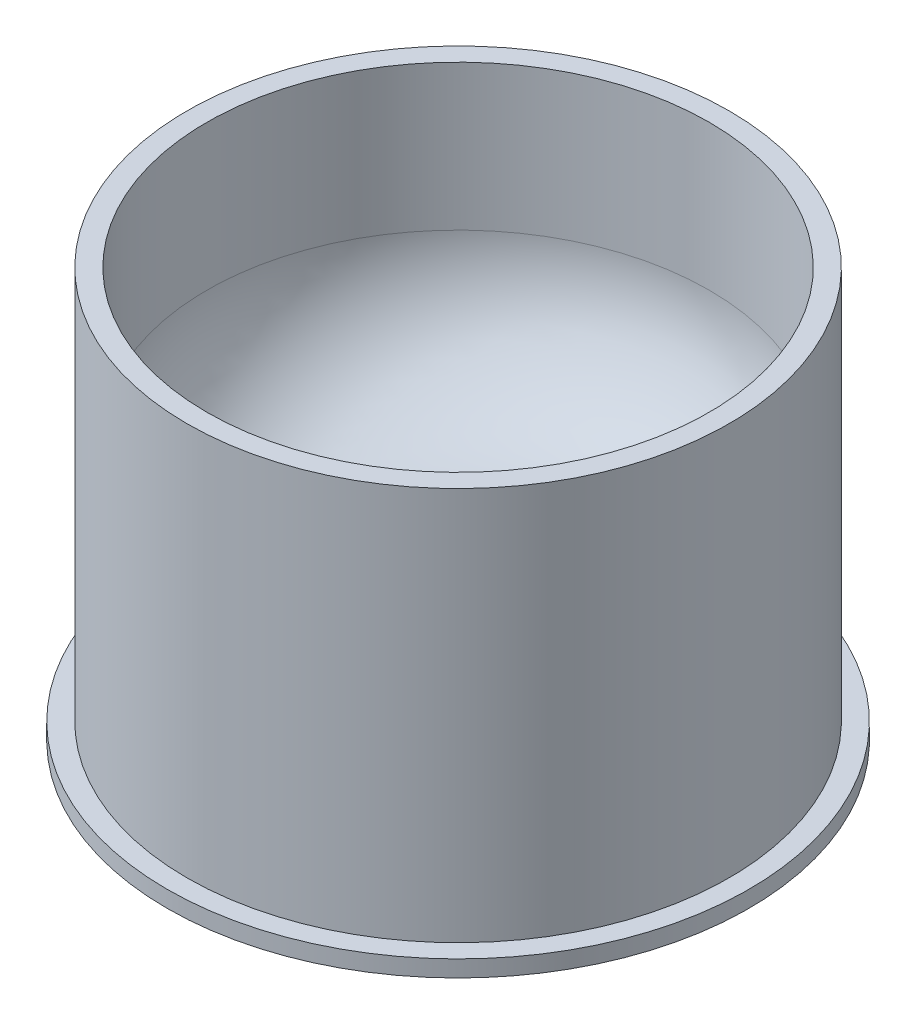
from build123d import *

# Parameters (mm, degrees)
SKETCH1_R           = 20.5
BOSS_EXTRUDE2_DEPTH = 31
SKETCH1_6_R         = 22
SKETCH1_6_R_2       = 20.5
BOSS_EXTRUDE3_DEPTH = 1.25
SKETCH2_R           = 17.5
BOSS_EXTRUDE4_DEPTH = 1
SKETCH3_R           = 19
CUT_EXTRUDE1_DEPTH  = 21
FILLET1_R           = 10


with BuildPart() as part:
    # Sketch1 → Boss-Extrude2 (new body)
    with BuildSketch(Plane(origin=(0, 0, 0), x_dir=(1, 0, 0), z_dir=(0, 1, 0))):
        with Locations(Location((0, 0, 0), (0, 0, 270))):
            Circle(SKETCH1_R)
    extrude(amount=BOSS_EXTRUDE2_DEPTH)

    # Sketch1_6 → Boss-Extrude3 (add)
    with BuildSketch(Plane(origin=(0, 0, 0), x_dir=(1, 0, 0), z_dir=(0, 1, 0))):
        with Locations(Location((0, 0, 0), (0, 0, 270))):
            Circle(SKETCH1_6_R)
        with Locations(Location((0, 0, 0), (0, 0, 270))):
            Circle(SKETCH1_6_R_2, mode=Mode.SUBTRACT)
    extrude(amount=BOSS_EXTRUDE3_DEPTH)

    # Sketch2 → Boss-Extrude4 (add)
    with BuildSketch(Plane.XZ):
        with Locations(Location((0, 0, 0), (0, 0, 270))):
            Circle(SKETCH2_R)
    extrude(amount=BOSS_EXTRUDE4_DEPTH)

    # Sketch3 → Cut-Extrude1 (cut)
    with BuildSketch(Plane(origin=(0, 31, 0), x_dir=(1, 0, 0), z_dir=(0, 1, 0))):
        with Locations(Location((0, 0, 0), (0, 0, 270))):
            Circle(SKETCH3_R)
    extrude(amount=-CUT_EXTRUDE1_DEPTH, mode=Mode.SUBTRACT)

    # Fillet1
    fillet1_edges = [part.edges().sort_by_distance(p)[0] for p in [
        (0, 10, -19),
    ]]
    fillet(fillet1_edges, radius=FILLET1_R)


solid = part.part
